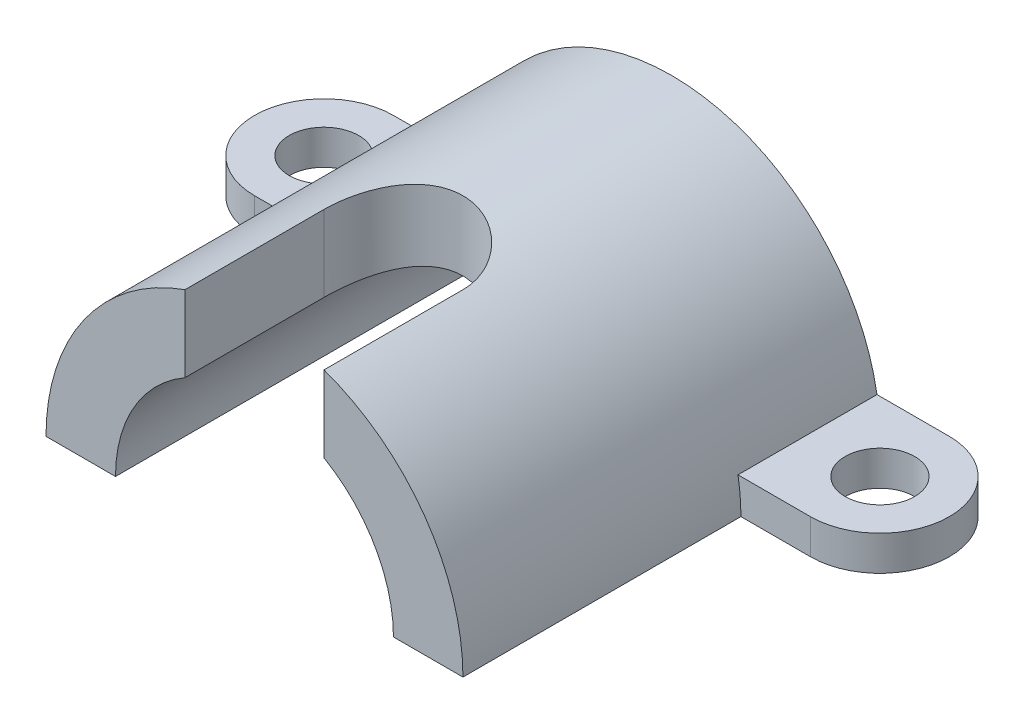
ISO-10303-21;
HEADER;
FILE_DESCRIPTION(('STEP AP214'),'2;1');
FILE_NAME('part.step','',(''),(''),'','','');
FILE_SCHEMA(('AUTOMOTIVE_DESIGN { 1 0 10303 214 1 1 1 1 }'));
ENDSEC;
DATA;
#1=APPLICATION_CONTEXT('core data for automotive mechanical design processes');
#2=APPLICATION_PROTOCOL_DEFINITION('international standard','automotive_design',2000,#1);
#3=PRODUCT_CONTEXT('',#1,'mechanical');
#4=PRODUCT('Part','Part','',(#3));
#5=PRODUCT_RELATED_PRODUCT_CATEGORY('part','',(#4));
#6=PRODUCT_DEFINITION_FORMATION('','',#4);
#7=PRODUCT_DEFINITION_CONTEXT('part definition',#1,'design');
#8=PRODUCT_DEFINITION('design','',#6,#7);
#9=PRODUCT_DEFINITION_SHAPE('','',#8);
#10=(LENGTH_UNIT() NAMED_UNIT(*) SI_UNIT(.MILLI.,.METRE.));
#11=(NAMED_UNIT(*) PLANE_ANGLE_UNIT() SI_UNIT($,.RADIAN.));
#12=(NAMED_UNIT(*) SI_UNIT($,.STERADIAN.) SOLID_ANGLE_UNIT());
#13=UNCERTAINTY_MEASURE_WITH_UNIT(LENGTH_MEASURE(1.E-05),#10,'distance_accuracy_value','');
#14=(GEOMETRIC_REPRESENTATION_CONTEXT(3) GLOBAL_UNCERTAINTY_ASSIGNED_CONTEXT((#13)) GLOBAL_UNIT_ASSIGNED_CONTEXT((#10,
#11,#12)) REPRESENTATION_CONTEXT('',''));
#15=CARTESIAN_POINT('',(0.,0.,0.));
#16=DIRECTION('',(0.,0.,1.));
#17=DIRECTION('',(1.,0.,0.));
#18=AXIS2_PLACEMENT_3D('',#15,#16,#17);
#19=CARTESIAN_POINT('',(0.,0.,40.));
#20=DIRECTION('',(0.,-1.,0.));
#21=DIRECTION('',(0.,0.,-1.));
#22=AXIS2_PLACEMENT_3D('',#19,#20,#21);
#23=CYLINDRICAL_SURFACE('',#22,10.);
#24=CARTESIAN_POINT('',(10.,17.3205080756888,40.));
#25=CARTESIAN_POINT('',(10.0000009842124,17.3205050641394,39.8690518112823));
#26=CARTESIAN_POINT('',(9.99742732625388,17.3219937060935,39.7381220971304));
#27=CARTESIAN_POINT('',(9.98714776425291,17.3279234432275,39.4765381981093));
#28=CARTESIAN_POINT('',(9.9794421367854,17.3323643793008,39.3458839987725));
#29=CARTESIAN_POINT('',(9.94866974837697,17.3500596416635,38.9548912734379));
#30=CARTESIAN_POINT('',(9.91794741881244,17.3676865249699,38.695300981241));
#31=CARTESIAN_POINT('',(9.83673629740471,17.4138095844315,38.1818040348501));
#32=CARTESIAN_POINT('',(9.78636180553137,17.4422428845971,37.9278733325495));
#33=CARTESIAN_POINT('',(9.66646257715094,17.5089748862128,37.4258783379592));
#34=CARTESIAN_POINT('',(9.59693564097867,17.5472747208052,37.1778147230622));
#35=CARTESIAN_POINT('',(9.43968016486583,17.6323679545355,36.6897095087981));
#36=CARTESIAN_POINT('',(9.35199562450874,17.6791407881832,36.4496501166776));
#37=CARTESIAN_POINT('',(9.15913679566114,17.7798210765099,35.9781654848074));
#38=CARTESIAN_POINT('',(9.05395571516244,17.8337313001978,35.7467436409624));
#39=CARTESIAN_POINT('',(8.71317979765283,18.0040295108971,35.0666814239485));
#40=CARTESIAN_POINT('',(8.45244203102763,18.12893414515,34.6325199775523));
#41=CARTESIAN_POINT('',(7.84654710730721,18.3997336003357,33.7767656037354));
#42=CARTESIAN_POINT('',(7.49622958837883,18.5465096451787,33.3591048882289));
#43=CARTESIAN_POINT('',(6.9233891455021,18.7645590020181,32.7791476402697));
#44=CARTESIAN_POINT('',(6.7244100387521,18.8369339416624,32.5934834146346));
#45=CARTESIAN_POINT('',(6.31150716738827,18.9792644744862,32.2386273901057));
#46=CARTESIAN_POINT('',(6.09758884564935,19.0492209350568,32.0694296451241));
#47=CARTESIAN_POINT('',(5.64077173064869,19.1896485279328,31.7376325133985));
#48=CARTESIAN_POINT('',(5.39689141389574,19.2598321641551,31.5762609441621));
#49=CARTESIAN_POINT('',(4.89455061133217,19.3935793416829,31.2747967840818));
#50=CARTESIAN_POINT('',(4.63608928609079,19.4571425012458,31.1347054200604));
#51=CARTESIAN_POINT('',(4.10635677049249,19.5757876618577,30.8772530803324));
#52=CARTESIAN_POINT('',(3.83509177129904,19.6308737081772,30.7598812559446));
#53=CARTESIAN_POINT('',(3.28159507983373,19.7309449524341,30.5491378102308));
#54=CARTESIAN_POINT('',(2.99936455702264,19.7759312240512,30.4557636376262));
#55=CARTESIAN_POINT('',(2.44661833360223,19.8516058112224,30.2999718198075));
#56=CARTESIAN_POINT('',(2.17669780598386,19.8830836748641,30.2358243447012));
#57=CARTESIAN_POINT('',(1.63144213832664,19.9352295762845,30.1300708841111));
#58=CARTESIAN_POINT('',(1.35610723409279,19.9558980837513,30.0884639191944));
#59=CARTESIAN_POINT('',(0.802445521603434,19.9858175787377,30.0283610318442));
#60=CARTESIAN_POINT('',(0.524120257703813,19.995074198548,30.0098537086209));
#61=CARTESIAN_POINT('',(-0.0332395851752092,20.0019136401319,29.9961712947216));
#62=CARTESIAN_POINT('',(-0.312274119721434,19.9994971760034,30.0009947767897));
#63=CARTESIAN_POINT('',(-0.844367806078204,19.9837838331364,30.0324641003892));
#64=CARTESIAN_POINT('',(-1.0975729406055,19.9714527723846,30.0571730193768));
#65=CARTESIAN_POINT('',(-1.60073183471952,19.9374328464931,30.1256841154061));
#66=CARTESIAN_POINT('',(-1.85068582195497,19.9157446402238,30.1694849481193));
#67=CARTESIAN_POINT('',(-2.34565858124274,19.8635300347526,30.2757025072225));
#68=CARTESIAN_POINT('',(-2.59067728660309,19.8330035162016,30.3381194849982));
#69=CARTESIAN_POINT('',(-3.07423528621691,19.7638242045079,30.4809325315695));
#70=CARTESIAN_POINT('',(-3.31277434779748,19.7251711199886,30.561329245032));
#71=CARTESIAN_POINT('',(-3.78518954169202,19.6400282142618,30.7405713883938));
#72=CARTESIAN_POINT('',(-4.01895833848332,19.5934390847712,30.83965255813));
#73=CARTESIAN_POINT('',(-4.47722056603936,19.4938343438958,31.054686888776));
#74=CARTESIAN_POINT('',(-4.70171067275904,19.4408164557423,31.1706460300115));
#75=CARTESIAN_POINT('',(-5.35951315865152,19.2738119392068,31.5425105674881));
#76=CARTESIAN_POINT('',(-5.77743531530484,19.1518223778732,31.8225093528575));
#77=CARTESIAN_POINT('',(-6.6018272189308,18.8844158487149,32.4690181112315));
#78=CARTESIAN_POINT('',(-7.00348722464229,18.7378744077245,32.8412012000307));
#79=CARTESIAN_POINT('',(-7.55652262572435,18.5186003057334,33.4445709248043));
#80=CARTESIAN_POINT('',(-7.73274718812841,18.445540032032,33.653396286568));
#81=CARTESIAN_POINT('',(-8.06789407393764,18.3014290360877,34.0852931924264));
#82=CARTESIAN_POINT('',(-8.22681373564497,18.2303786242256,34.3083669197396));
#83=CARTESIAN_POINT('',(-8.53597765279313,18.0877840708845,34.7825020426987));
#84=CARTESIAN_POINT('',(-8.68500029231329,18.0165039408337,35.0344405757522));
#85=CARTESIAN_POINT('',(-8.96097966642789,17.8808412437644,35.5517721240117));
#86=CARTESIAN_POINT('',(-9.08794650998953,17.816455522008,35.817158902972));
#87=CARTESIAN_POINT('',(-9.31839935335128,17.6970127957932,36.3593871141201));
#88=CARTESIAN_POINT('',(-9.42192743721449,17.6419391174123,36.6362069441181));
#89=CARTESIAN_POINT('',(-9.60448489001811,17.5432230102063,37.1997331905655));
#90=CARTESIAN_POINT('',(-9.68352487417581,17.4995756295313,37.4864352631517));
#91=CARTESIAN_POINT('',(-9.79104748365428,17.439541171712,37.9579580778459));
#92=CARTESIAN_POINT('',(-9.82736239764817,17.4190767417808,38.1405160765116));
#93=CARTESIAN_POINT('',(-9.88980406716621,17.3837011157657,38.5078654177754));
#94=CARTESIAN_POINT('',(-9.91593364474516,17.368788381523,38.692656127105));
#95=CARTESIAN_POINT('',(-9.95786509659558,17.3447842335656,39.0641043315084));
#96=CARTESIAN_POINT('',(-9.973649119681,17.3357028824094,39.2507644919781));
#97=CARTESIAN_POINT('',(-9.99472523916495,17.323553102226,39.6249466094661));
#98=CARTESIAN_POINT('',(-10.0000130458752,17.3204871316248,39.8124688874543));
#99=CARTESIAN_POINT('',(-9.99999999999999,17.3205080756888,40.));
#100=B_SPLINE_CURVE_WITH_KNOTS('',3,(#24,#25,#26,#27,#28,#29,#30,#31,#32,#33,#34,#35,#36,#37,
#38,#39,#40,#41,#42,#43,#44,#45,#46,#47,#48,#49,#50,#51,#52,#53,#54,#55,#56,#57,#58,#59,#60,#61,
#62,#63,#64,#65,#66,#67,#68,#69,#70,#71,#72,#73,#74,#75,#76,#77,#78,#79,#80,#81,#82,#83,#84,#85,
#86,#87,#88,#89,#90,#91,#92,#93,#94,#95,#96,#97,#98,#99),.UNSPECIFIED.,.F.,.F.,(4,2,2,2,2,2,2,2,
2,2,2,2,2,2,2,2,2,2,2,2,2,2,2,2,2,2,2,2,2,2,2,2,2,2,2,2,2,4),(0.,0.392774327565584,
0.785527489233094,1.57037135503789,2.35071691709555,3.13115213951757,3.90971788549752,
4.68858657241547,6.24719698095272,7.93328360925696,8.77737560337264,9.62116165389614,
10.5222327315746,11.4233557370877,12.3240473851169,13.2246432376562,14.0611635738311,
14.8976475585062,15.7337185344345,16.5697383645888,17.3329555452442,18.096118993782,
18.8592927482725,19.6224938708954,20.3960608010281,21.1699024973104,22.7166903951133,
24.4095700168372,25.2573755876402,26.1053113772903,27.007965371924,27.9102045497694,
28.8108106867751,29.7110258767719,30.2724648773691,30.833748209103,31.3959974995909,
31.9584765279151),.UNSPECIFIED.);
#101=CARTESIAN_POINT('',(10.,17.3205080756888,40.));
#102=VERTEX_POINT('',#101);
#103=CARTESIAN_POINT('',(-9.99999999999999,17.3205080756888,40.));
#104=VERTEX_POINT('',#103);
#105=EDGE_CURVE('E147',#102,#104,#100,.T.);
#106=ORIENTED_EDGE('',*,*,#105,.F.);
#107=DIRECTION('',(0.,1.,0.));
#108=VECTOR('',#107,1.);
#109=CARTESIAN_POINT('',(10.,0.,40.));
#110=LINE('',#109,#108);
#111=CARTESIAN_POINT('',(10.,28.2842712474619,40.));
#112=VERTEX_POINT('',#111);
#113=EDGE_CURVE('E179',#112,#102,#110,.F.);
#114=ORIENTED_EDGE('',*,*,#113,.F.);
#115=CARTESIAN_POINT('',(-9.99999999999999,28.2842712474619,40.));
#116=CARTESIAN_POINT('',(-10.0000387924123,28.2842264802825,39.727176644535));
#117=CARTESIAN_POINT('',(-9.98883690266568,28.2882171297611,39.4543701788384));
#118=CARTESIAN_POINT('',(-9.94424041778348,28.3039415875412,38.9108733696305));
#119=CARTESIAN_POINT('',(-9.91085181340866,28.315673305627,38.640182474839));
#120=CARTESIAN_POINT('',(-9.82230119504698,28.3465069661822,38.1036429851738));
#121=CARTESIAN_POINT('',(-9.76720376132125,28.3655870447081,37.8377824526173));
#122=CARTESIAN_POINT('',(-9.63575739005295,28.4105091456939,37.3119496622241));
#123=CARTESIAN_POINT('',(-9.55940768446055,28.4363514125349,37.0519776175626));
#124=CARTESIAN_POINT('',(-9.38619298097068,28.4939938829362,36.5398857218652));
#125=CARTESIAN_POINT('',(-9.28934454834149,28.5257892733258,36.2877597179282));
#126=CARTESIAN_POINT('',(-9.07584153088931,28.5944342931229,35.7926481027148));
#127=CARTESIAN_POINT('',(-8.95917958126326,28.6312858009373,35.5496659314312));
#128=CARTESIAN_POINT('',(-8.70689858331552,28.7090113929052,35.0743177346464));
#129=CARTESIAN_POINT('',(-8.57127278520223,28.7498869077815,34.8419555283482));
#130=CARTESIAN_POINT('',(-8.28201890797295,28.8345429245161,34.3892674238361));
#131=CARTESIAN_POINT('',(-8.12838972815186,28.8783236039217,34.1689422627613));
#132=CARTESIAN_POINT('',(-7.79838011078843,28.9692177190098,33.7340295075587));
#133=CARTESIAN_POINT('',(-7.6213879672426,29.0163942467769,33.5199190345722));
#134=CARTESIAN_POINT('',(-7.25028661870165,29.1113383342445,33.1072243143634));
#135=CARTESIAN_POINT('',(-7.05617709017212,29.1591059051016,32.9086403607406));
#136=CARTESIAN_POINT('',(-6.651990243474,29.2539589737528,32.5281818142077));
#137=CARTESIAN_POINT('',(-6.441909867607,29.3010443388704,32.3463104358));
#138=CARTESIAN_POINT('',(-6.00708660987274,29.3932695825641,32.0004954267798));
#139=CARTESIAN_POINT('',(-5.78234416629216,29.438409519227,31.8365512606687));
#140=CARTESIAN_POINT('',(-5.31343445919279,29.5266965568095,31.5236245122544));
#141=CARTESIAN_POINT('',(-5.06891098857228,29.5697595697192,31.3751512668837));
#142=CARTESIAN_POINT('',(-4.56755046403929,29.651339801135,31.0994782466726));
#143=CARTESIAN_POINT('',(-4.31071832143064,29.6898588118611,30.9722700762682));
#144=CARTESIAN_POINT('',(-3.78642403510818,29.7612663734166,30.7401306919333));
#145=CARTESIAN_POINT('',(-3.51896226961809,29.7941551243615,30.6351986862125));
#146=CARTESIAN_POINT('',(-2.97534494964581,29.8533425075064,30.4485655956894));
#147=CARTESIAN_POINT('',(-2.6991897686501,29.879641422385,30.366863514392));
#148=CARTESIAN_POINT('',(-2.15001476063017,29.9240817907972,30.229906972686));
#149=CARTESIAN_POINT('',(-1.87721995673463,29.9424751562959,30.173831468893));
#150=CARTESIAN_POINT('',(-1.3275127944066,29.97187778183,30.0845959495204));
#151=CARTESIAN_POINT('',(-1.05060052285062,29.9828871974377,30.0514354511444));
#152=CARTESIAN_POINT('',(-0.494831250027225,29.9972065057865,30.0083629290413));
#153=CARTESIAN_POINT('',(-0.215974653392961,30.0005179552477,29.9984462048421));
#154=CARTESIAN_POINT('',(0.341572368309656,29.999350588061,30.0019481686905));
#155=CARTESIAN_POINT('',(0.620262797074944,29.994871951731,30.0153663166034));
#156=CARTESIAN_POINT('',(1.16440565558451,29.9785811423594,30.0644158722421));
#157=CARTESIAN_POINT('',(1.42994803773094,29.967063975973,30.0991539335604));
#158=CARTESIAN_POINT('',(1.95701595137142,29.9372637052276,30.1897204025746));
#159=CARTESIAN_POINT('',(2.21854160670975,29.9189808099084,30.2455481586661));
#160=CARTESIAN_POINT('',(2.73575759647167,29.8761270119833,30.3777927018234));
#161=CARTESIAN_POINT('',(2.99144882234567,29.851557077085,30.4542063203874));
#162=CARTESIAN_POINT('',(3.49546118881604,29.796745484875,30.6270199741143));
#163=CARTESIAN_POINT('',(3.74377949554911,29.766501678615,30.7234275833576));
#164=CARTESIAN_POINT('',(4.23450803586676,29.700690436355,30.9368085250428));
#165=CARTESIAN_POINT('',(4.47680253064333,29.6650600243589,31.054028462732));
#166=CARTESIAN_POINT('',(4.95074987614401,29.5896550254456,31.3073418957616));
#167=CARTESIAN_POINT('',(5.18239876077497,29.5498789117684,31.4434423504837));
#168=CARTESIAN_POINT('',(5.63361763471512,29.4671846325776,31.7335439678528));
#169=CARTESIAN_POINT('',(5.85318718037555,29.4242663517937,31.8875457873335));
#170=CARTESIAN_POINT('',(6.27900118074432,29.3363497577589,32.2124540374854));
#171=CARTESIAN_POINT('',(6.48524515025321,29.291351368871,32.3833610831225));
#172=CARTESIAN_POINT('',(6.89266306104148,29.1982345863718,32.7495029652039));
#173=CARTESIAN_POINT('',(7.09313668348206,29.1500692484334,32.9455058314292));
#174=CARTESIAN_POINT('',(7.47687411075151,29.0540095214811,33.3535896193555));
#175=CARTESIAN_POINT('',(7.66014503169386,29.0061150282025,33.5656638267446));
#176=CARTESIAN_POINT('',(8.00852948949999,28.9118669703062,34.0048293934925));
#177=CARTESIAN_POINT('',(8.17362931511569,28.8655145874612,34.2319318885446));
#178=CARTESIAN_POINT('',(8.48432319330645,28.7757260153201,34.6995262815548));
#179=CARTESIAN_POINT('',(8.62992497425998,28.7322886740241,34.9400128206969));
#180=CARTESIAN_POINT('',(8.90269365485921,28.6489564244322,35.436718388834));
#181=CARTESIAN_POINT('',(9.02954551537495,28.6091256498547,35.6931214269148));
#182=CARTESIAN_POINT('',(9.2610158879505,28.5350373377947,36.2164296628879));
#183=CARTESIAN_POINT('',(9.36564366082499,28.5007774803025,36.4833304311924));
#184=CARTESIAN_POINT('',(9.55168206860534,28.4389695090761,37.0255381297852));
#185=CARTESIAN_POINT('',(9.63311795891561,28.4114140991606,37.3008355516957));
#186=CARTESIAN_POINT('',(9.772097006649,28.363911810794,37.8579216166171));
#187=CARTESIAN_POINT('',(9.82965107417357,28.3439614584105,38.1397072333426));
#188=CARTESIAN_POINT('',(9.91654882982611,28.3136733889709,38.6841058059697));
#189=CARTESIAN_POINT('',(9.94783425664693,28.3026763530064,38.9463736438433));
#190=CARTESIAN_POINT('',(9.98956249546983,28.2879607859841,39.4724209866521));
#191=CARTESIAN_POINT('',(10.0000322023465,28.2842328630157,39.7361980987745));
#192=CARTESIAN_POINT('',(10.,28.2842712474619,40.));
#193=B_SPLINE_CURVE_WITH_KNOTS('',3,(#115,#116,#117,#118,#119,#120,#121,#122,#123,#124,#125,
#126,#127,#128,#129,#130,#131,#132,#133,#134,#135,#136,#137,#138,#139,#140,#141,#142,#143,#144,
#145,#146,#147,#148,#149,#150,#151,#152,#153,#154,#155,#156,#157,#158,#159,#160,#161,#162,#163,
#164,#165,#166,#167,#168,#169,#170,#171,#172,#173,#174,#175,#176,#177,#178,#179,#180,#181,#182,
#183,#184,#185,#186,#187,#188,#189,#190,#191,#192),.UNSPECIFIED.,.F.,.F.,(4,2,2,2,2,2,2,2,2,2,2,
2,2,2,2,2,2,2,2,2,2,2,2,2,2,2,2,2,2,2,2,2,2,2,2,2,2,2,4),(0.,0.818184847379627,1.63614886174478,
2.45169771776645,3.26727605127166,4.08219780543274,4.89742313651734,5.7129393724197,
6.52850549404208,7.37286263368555,8.21723573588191,9.06177090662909,9.90628084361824,
10.7730890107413,11.6395541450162,12.5059884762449,13.3723856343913,14.2086484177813,
15.0448935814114,15.8809696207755,16.7170263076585,17.5202388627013,18.3234266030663,
19.1264907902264,19.9298597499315,20.7434745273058,21.5573900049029,22.3713353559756,
23.1853103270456,24.0377558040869,24.8898470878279,25.7425769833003,26.5949678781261,
27.46035943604,28.3253896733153,29.1894742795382,30.0531637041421,30.8453164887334,
31.6364451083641),.UNSPECIFIED.);
#194=CARTESIAN_POINT('',(-9.99999999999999,28.2842712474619,40.));
#195=VERTEX_POINT('',#194);
#196=EDGE_CURVE('E39',#112,#195,#193,.F.);
#197=ORIENTED_EDGE('',*,*,#196,.T.);
#198=DIRECTION('',(0.,1.,0.));
#199=VECTOR('',#198,1.);
#200=CARTESIAN_POINT('',(-9.99999999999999,0.,40.));
#201=LINE('',#200,#199);
#202=EDGE_CURVE('E177',#104,#195,#201,.T.);
#203=ORIENTED_EDGE('',*,*,#202,.F.);
#204=EDGE_LOOP('',(#106,#114,#197,#203));
#205=FACE_BOUND('',#204,.T.);
#206=ADVANCED_FACE('F31',(#205),#23,.F.);
#207=CARTESIAN_POINT('',(-30.,0.,60.));
#208=DIRECTION('',(0.,1.,0.));
#209=DIRECTION('',(0.,0.,1.));
#210=AXIS2_PLACEMENT_3D('',#207,#208,#209);
#211=PLANE('',#210);
#212=CARTESIAN_POINT('',(40.,0.,9.99999999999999));
#213=DIRECTION('',(0.,1.,0.));
#214=DIRECTION('',(0.,0.,1.));
#215=AXIS2_PLACEMENT_3D('',#212,#213,#214);
#216=CIRCLE('',#215,5.);
#217=CARTESIAN_POINT('',(40.,0.,15.));
#218=VERTEX_POINT('',#217);
#219=EDGE_CURVE('E252',#218,#218,#216,.T.);
#220=ORIENTED_EDGE('',*,*,#219,.T.);
#221=EDGE_LOOP('',(#220));
#222=FACE_BOUND('',#221,.T.);
#223=DIRECTION('',(0.,0.,-1.));
#224=VECTOR('',#223,1.);
#225=CARTESIAN_POINT('',(20.,0.,60.));
#226=LINE('',#225,#224);
#227=CARTESIAN_POINT('',(20.,0.,0.));
#228=VERTEX_POINT('',#227);
#229=CARTESIAN_POINT('',(20.,0.,60.));
#230=VERTEX_POINT('',#229);
#231=EDGE_CURVE('E130',#228,#230,#226,.F.);
#232=ORIENTED_EDGE('',*,*,#231,.F.);
#233=DIRECTION('',(1.,0.,0.));
#234=VECTOR('',#233,1.);
#235=CARTESIAN_POINT('',(-30.,0.,0.));
#236=LINE('',#235,#234);
#237=CARTESIAN_POINT('',(40.,0.,0.));
#238=VERTEX_POINT('',#237);
#239=EDGE_CURVE('E165',#228,#238,#236,.T.);
#240=ORIENTED_EDGE('',*,*,#239,.T.);
#241=CARTESIAN_POINT('',(40.,0.,9.99999999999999));
#242=DIRECTION('',(0.,-1.,0.));
#243=DIRECTION('',(0.,0.,-1.));
#244=AXIS2_PLACEMENT_3D('',#241,#242,#243);
#245=CIRCLE('',#244,10.);
#246=CARTESIAN_POINT('',(40.,0.,20.));
#247=VERTEX_POINT('',#246);
#248=EDGE_CURVE('E282',#238,#247,#245,.T.);
#249=ORIENTED_EDGE('',*,*,#248,.T.);
#250=DIRECTION('',(-1.,0.,0.));
#251=VECTOR('',#250,1.);
#252=CARTESIAN_POINT('',(-40.,0.,20.));
#253=LINE('',#252,#251);
#254=CARTESIAN_POINT('',(30.,0.,20.));
#255=VERTEX_POINT('',#254);
#256=EDGE_CURVE('E268',#247,#255,#253,.T.);
#257=ORIENTED_EDGE('',*,*,#256,.T.);
#258=DIRECTION('',(0.,0.,-1.));
#259=VECTOR('',#258,1.);
#260=CARTESIAN_POINT('',(30.,0.,60.));
#261=LINE('',#260,#259);
#262=CARTESIAN_POINT('',(30.,0.,60.));
#263=VERTEX_POINT('',#262);
#264=EDGE_CURVE('E152',#263,#255,#261,.T.);
#265=ORIENTED_EDGE('',*,*,#264,.F.);
#266=DIRECTION('',(1.,0.,0.));
#267=VECTOR('',#266,1.);
#268=CARTESIAN_POINT('',(-30.,0.,60.));
#269=LINE('',#268,#267);
#270=EDGE_CURVE('E144',#230,#263,#269,.T.);
#271=ORIENTED_EDGE('',*,*,#270,.F.);
#272=EDGE_LOOP('',(#232,#240,#249,#257,#265,#271));
#273=FACE_BOUND('',#272,.T.);
#274=ADVANCED_FACE('F150',(#222,#273),#211,.F.);
#275=CARTESIAN_POINT('',(-40.,0.,10.));
#276=DIRECTION('',(0.,1.,0.));
#277=DIRECTION('',(0.,0.,1.));
#278=AXIS2_PLACEMENT_3D('',#275,#276,#277);
#279=CIRCLE('',#278,5.);
#280=CARTESIAN_POINT('',(-40.,0.,15.));
#281=VERTEX_POINT('',#280);
#282=EDGE_CURVE('E258',#281,#281,#279,.T.);
#283=ORIENTED_EDGE('',*,*,#282,.T.);
#284=EDGE_LOOP('',(#283));
#285=FACE_BOUND('',#284,.T.);
#286=DIRECTION('',(0.,0.,-1.));
#287=VECTOR('',#286,1.);
#288=CARTESIAN_POINT('',(-20.,0.,60.));
#289=LINE('',#288,#287);
#290=CARTESIAN_POINT('',(-20.,0.,60.));
#291=VERTEX_POINT('',#290);
#292=CARTESIAN_POINT('',(-20.,0.,0.));
#293=VERTEX_POINT('',#292);
#294=EDGE_CURVE('E138',#291,#293,#289,.T.);
#295=ORIENTED_EDGE('',*,*,#294,.F.);
#296=CARTESIAN_POINT('',(-30.,0.,60.));
#297=VERTEX_POINT('',#296);
#298=EDGE_CURVE('E154',#297,#291,#269,.T.);
#299=ORIENTED_EDGE('',*,*,#298,.F.);
#300=DIRECTION('',(0.,0.,-1.));
#301=VECTOR('',#300,1.);
#302=CARTESIAN_POINT('',(-30.,0.,60.));
#303=LINE('',#302,#301);
#304=CARTESIAN_POINT('',(-30.,0.,20.));
#305=VERTEX_POINT('',#304);
#306=EDGE_CURVE('E171',#297,#305,#303,.T.);
#307=ORIENTED_EDGE('',*,*,#306,.T.);
#308=CARTESIAN_POINT('',(-40.,0.,20.));
#309=VERTEX_POINT('',#308);
#310=EDGE_CURVE('E285',#305,#309,#253,.T.);
#311=ORIENTED_EDGE('',*,*,#310,.T.);
#312=CARTESIAN_POINT('',(-40.,0.,10.));
#313=DIRECTION('',(0.,-1.,0.));
#314=DIRECTION('',(0.,0.,-1.));
#315=AXIS2_PLACEMENT_3D('',#312,#313,#314);
#316=CIRCLE('',#315,10.);
#317=CARTESIAN_POINT('',(-40.,0.,0.));
#318=VERTEX_POINT('',#317);
#319=EDGE_CURVE('E261',#309,#318,#316,.T.);
#320=ORIENTED_EDGE('',*,*,#319,.T.);
#321=EDGE_CURVE('E167',#318,#293,#236,.T.);
#322=ORIENTED_EDGE('',*,*,#321,.T.);
#323=EDGE_LOOP('',(#295,#299,#307,#311,#320,#322));
#324=FACE_BOUND('',#323,.T.);
#325=ADVANCED_FACE('F192',(#285,#324),#211,.F.);
#326=CARTESIAN_POINT('',(0.,0.,60.));
#327=DIRECTION('',(0.,0.,1.));
#328=DIRECTION('',(1.,0.,0.));
#329=AXIS2_PLACEMENT_3D('',#326,#327,#328);
#330=PLANE('',#329);
#331=ORIENTED_EDGE('',*,*,#298,.T.);
#332=CARTESIAN_POINT('',(0.,0.,60.));
#333=DIRECTION('',(0.,0.,1.));
#334=DIRECTION('',(1.,0.,0.));
#335=AXIS2_PLACEMENT_3D('',#332,#333,#334);
#336=CIRCLE('',#335,20.);
#337=CARTESIAN_POINT('',(-9.99999999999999,17.3205080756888,60.));
#338=VERTEX_POINT('',#337);
#339=EDGE_CURVE('E148',#338,#291,#336,.T.);
#340=ORIENTED_EDGE('',*,*,#339,.F.);
#341=DIRECTION('',(0.,1.,0.));
#342=VECTOR('',#341,1.);
#343=CARTESIAN_POINT('',(-9.99999999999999,0.,60.));
#344=LINE('',#343,#342);
#345=CARTESIAN_POINT('',(-9.99999999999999,28.2842712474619,60.));
#346=VERTEX_POINT('',#345);
#347=EDGE_CURVE('E175',#338,#346,#344,.T.);
#348=ORIENTED_EDGE('',*,*,#347,.T.);
#349=CARTESIAN_POINT('',(0.,0.,60.));
#350=DIRECTION('',(0.,0.,1.));
#351=DIRECTION('',(1.,0.,0.));
#352=AXIS2_PLACEMENT_3D('',#349,#350,#351);
#353=CIRCLE('',#352,30.);
#354=EDGE_CURVE('E158',#346,#297,#353,.T.);
#355=ORIENTED_EDGE('',*,*,#354,.T.);
#356=EDGE_LOOP('',(#331,#340,#348,#355));
#357=FACE_BOUND('',#356,.T.);
#358=ADVANCED_FACE('F199',(#357),#330,.T.);
#359=DIRECTION('',(0.,-1.,0.));
#360=VECTOR('',#359,1.);
#361=CARTESIAN_POINT('',(10.,0.,60.));
#362=LINE('',#361,#360);
#363=CARTESIAN_POINT('',(10.,28.2842712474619,60.));
#364=VERTEX_POINT('',#363);
#365=CARTESIAN_POINT('',(10.,17.3205080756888,60.));
#366=VERTEX_POINT('',#365);
#367=EDGE_CURVE('E146',#364,#366,#362,.T.);
#368=ORIENTED_EDGE('',*,*,#367,.T.);
#369=EDGE_CURVE('E46',#230,#366,#336,.T.);
#370=ORIENTED_EDGE('',*,*,#369,.F.);
#371=ORIENTED_EDGE('',*,*,#270,.T.);
#372=EDGE_CURVE('E155',#263,#364,#353,.T.);
#373=ORIENTED_EDGE('',*,*,#372,.T.);
#374=EDGE_LOOP('',(#368,#370,#371,#373));
#375=FACE_BOUND('',#374,.T.);
#376=ADVANCED_FACE('F142',(#375),#330,.T.);
#377=CARTESIAN_POINT('',(0.,0.,0.));
#378=DIRECTION('',(0.,0.,1.));
#379=DIRECTION('',(1.,0.,0.));
#380=AXIS2_PLACEMENT_3D('',#377,#378,#379);
#381=PLANE('',#380);
#382=CARTESIAN_POINT('',(0.,0.,0.));
#383=DIRECTION('',(0.,0.,1.));
#384=DIRECTION('',(1.,0.,0.));
#385=AXIS2_PLACEMENT_3D('',#382,#383,#384);
#386=CIRCLE('',#385,20.);
#387=EDGE_CURVE('E133',#228,#293,#386,.T.);
#388=ORIENTED_EDGE('',*,*,#387,.T.);
#389=ORIENTED_EDGE('',*,*,#321,.F.);
#390=DIRECTION('',(0.,-1.,0.));
#391=VECTOR('',#390,1.);
#392=CARTESIAN_POINT('',(-40.,5.,0.));
#393=LINE('',#392,#391);
#394=CARTESIAN_POINT('',(-40.,5.,0.));
#395=VERTEX_POINT('',#394);
#396=EDGE_CURVE('E279',#395,#318,#393,.T.);
#397=ORIENTED_EDGE('',*,*,#396,.F.);
#398=DIRECTION('',(1.,0.,0.));
#399=VECTOR('',#398,1.);
#400=CARTESIAN_POINT('',(-40.,5.,0.));
#401=LINE('',#400,#399);
#402=CARTESIAN_POINT('',(-29.5803989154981,5.,0.));
#403=VERTEX_POINT('',#402);
#404=EDGE_CURVE('E269',#395,#403,#401,.T.);
#405=ORIENTED_EDGE('',*,*,#404,.T.);
#406=CARTESIAN_POINT('',(0.,0.,0.));
#407=DIRECTION('',(0.,0.,1.));
#408=DIRECTION('',(1.,0.,0.));
#409=AXIS2_PLACEMENT_3D('',#406,#407,#408);
#410=CIRCLE('',#409,30.);
#411=CARTESIAN_POINT('',(29.5803989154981,5.,0.));
#412=VERTEX_POINT('',#411);
#413=EDGE_CURVE('E162',#412,#403,#410,.T.);
#414=ORIENTED_EDGE('',*,*,#413,.F.);
#415=CARTESIAN_POINT('',(40.,5.,0.));
#416=VERTEX_POINT('',#415);
#417=EDGE_CURVE('E267',#412,#416,#401,.T.);
#418=ORIENTED_EDGE('',*,*,#417,.T.);
#419=DIRECTION('',(0.,-1.,0.));
#420=VECTOR('',#419,1.);
#421=CARTESIAN_POINT('',(40.,5.,0.));
#422=LINE('',#421,#420);
#423=EDGE_CURVE('E293',#416,#238,#422,.T.);
#424=ORIENTED_EDGE('',*,*,#423,.T.);
#425=ORIENTED_EDGE('',*,*,#239,.F.);
#426=EDGE_LOOP('',(#388,#389,#397,#405,#414,#418,#424,#425));
#427=FACE_BOUND('',#426,.T.);
#428=ADVANCED_FACE('F194',(#427),#381,.F.);
#429=CARTESIAN_POINT('',(-10.,30.,30.));
#430=DIRECTION('',(1.,0.,0.));
#431=DIRECTION('',(0.,0.,-1.));
#432=AXIS2_PLACEMENT_3D('',#429,#430,#431);
#433=PLANE('',#432);
#434=ORIENTED_EDGE('',*,*,#347,.F.);
#435=DIRECTION('',(0.,0.,-1.));
#436=VECTOR('',#435,1.);
#437=CARTESIAN_POINT('',(-9.99999999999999,17.3205080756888,60.));
#438=LINE('',#437,#436);
#439=EDGE_CURVE('E242',#338,#104,#438,.T.);
#440=ORIENTED_EDGE('',*,*,#439,.T.);
#441=ORIENTED_EDGE('',*,*,#202,.T.);
#442=DIRECTION('',(0.,0.,-1.));
#443=VECTOR('',#442,1.);
#444=CARTESIAN_POINT('',(-9.99999999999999,28.2842712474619,60.));
#445=LINE('',#444,#443);
#446=EDGE_CURVE('E248',#195,#346,#445,.F.);
#447=ORIENTED_EDGE('',*,*,#446,.T.);
#448=EDGE_LOOP('',(#434,#440,#441,#447));
#449=FACE_BOUND('',#448,.T.);
#450=ADVANCED_FACE('F197',(#449),#433,.T.);
#451=CARTESIAN_POINT('',(10.,30.,30.));
#452=DIRECTION('',(-1.,0.,0.));
#453=DIRECTION('',(0.,0.,1.));
#454=AXIS2_PLACEMENT_3D('',#451,#452,#453);
#455=PLANE('',#454);
#456=ORIENTED_EDGE('',*,*,#113,.T.);
#457=DIRECTION('',(0.,0.,-1.));
#458=VECTOR('',#457,1.);
#459=CARTESIAN_POINT('',(10.,17.3205080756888,60.));
#460=LINE('',#459,#458);
#461=EDGE_CURVE('E11',#102,#366,#460,.F.);
#462=ORIENTED_EDGE('',*,*,#461,.T.);
#463=ORIENTED_EDGE('',*,*,#367,.F.);
#464=DIRECTION('',(0.,0.,-1.));
#465=VECTOR('',#464,1.);
#466=CARTESIAN_POINT('',(10.,28.2842712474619,60.));
#467=LINE('',#466,#465);
#468=EDGE_CURVE('E137',#364,#112,#467,.T.);
#469=ORIENTED_EDGE('',*,*,#468,.T.);
#470=EDGE_LOOP('',(#456,#462,#463,#469));
#471=FACE_BOUND('',#470,.T.);
#472=ADVANCED_FACE('F189',(#471),#455,.T.);
#473=CARTESIAN_POINT('',(0.,0.,60.));
#474=DIRECTION('',(0.,0.,-1.));
#475=DIRECTION('',(-1.,0.,0.));
#476=AXIS2_PLACEMENT_3D('',#473,#474,#475);
#477=CYLINDRICAL_SURFACE('',#476,30.);
#478=ORIENTED_EDGE('',*,*,#468,.F.);
#479=ORIENTED_EDGE('',*,*,#372,.F.);
#480=ORIENTED_EDGE('',*,*,#264,.T.);
#481=CARTESIAN_POINT('',(0.,0.,20.));
#482=DIRECTION('',(0.,0.,1.));
#483=DIRECTION('',(1.,0.,0.));
#484=AXIS2_PLACEMENT_3D('',#481,#482,#483);
#485=CIRCLE('',#484,30.);
#486=CARTESIAN_POINT('',(29.5803989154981,5.,20.));
#487=VERTEX_POINT('',#486);
#488=EDGE_CURVE('E166',#255,#487,#485,.T.);
#489=ORIENTED_EDGE('',*,*,#488,.T.);
#490=DIRECTION('',(0.,0.,-1.));
#491=VECTOR('',#490,1.);
#492=CARTESIAN_POINT('',(29.5803989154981,5.,60.));
#493=LINE('',#492,#491);
#494=EDGE_CURVE('E290',#412,#487,#493,.F.);
#495=ORIENTED_EDGE('',*,*,#494,.F.);
#496=ORIENTED_EDGE('',*,*,#413,.T.);
#497=DIRECTION('',(0.,0.,-1.));
#498=VECTOR('',#497,1.);
#499=CARTESIAN_POINT('',(-29.5803989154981,5.,60.));
#500=LINE('',#499,#498);
#501=CARTESIAN_POINT('',(-29.5803989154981,5.,20.));
#502=VERTEX_POINT('',#501);
#503=EDGE_CURVE('E300',#502,#403,#500,.T.);
#504=ORIENTED_EDGE('',*,*,#503,.F.);
#505=EDGE_CURVE('E301',#502,#305,#485,.T.);
#506=ORIENTED_EDGE('',*,*,#505,.T.);
#507=ORIENTED_EDGE('',*,*,#306,.F.);
#508=ORIENTED_EDGE('',*,*,#354,.F.);
#509=ORIENTED_EDGE('',*,*,#446,.F.);
#510=ORIENTED_EDGE('',*,*,#196,.F.);
#511=EDGE_LOOP('',(#478,#479,#480,#489,#495,#496,#504,#506,#507,#508,#509,#510));
#512=FACE_BOUND('',#511,.T.);
#513=ADVANCED_FACE('F184',(#512),#477,.T.);
#514=CARTESIAN_POINT('',(40.,5.,9.99999999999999));
#515=DIRECTION('',(0.,-1.,0.));
#516=DIRECTION('',(0.,0.,-1.));
#517=AXIS2_PLACEMENT_3D('',#514,#515,#516);
#518=CYLINDRICAL_SURFACE('',#517,10.);
#519=ORIENTED_EDGE('',*,*,#248,.F.);
#520=ORIENTED_EDGE('',*,*,#423,.F.);
#521=CARTESIAN_POINT('',(40.,5.,9.99999999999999));
#522=DIRECTION('',(0.,-1.,0.));
#523=DIRECTION('',(0.,0.,-1.));
#524=AXIS2_PLACEMENT_3D('',#521,#522,#523);
#525=CIRCLE('',#524,10.);
#526=CARTESIAN_POINT('',(40.,5.,20.));
#527=VERTEX_POINT('',#526);
#528=EDGE_CURVE('E272',#416,#527,#525,.T.);
#529=ORIENTED_EDGE('',*,*,#528,.T.);
#530=DIRECTION('',(0.,-1.,0.));
#531=VECTOR('',#530,1.);
#532=CARTESIAN_POINT('',(40.,5.,20.));
#533=LINE('',#532,#531);
#534=EDGE_CURVE('E291',#527,#247,#533,.T.);
#535=ORIENTED_EDGE('',*,*,#534,.T.);
#536=EDGE_LOOP('',(#519,#520,#529,#535));
#537=FACE_BOUND('',#536,.T.);
#538=ADVANCED_FACE('F188',(#537),#518,.T.);
#539=CARTESIAN_POINT('',(-40.,5.,10.));
#540=DIRECTION('',(0.,-1.,0.));
#541=DIRECTION('',(0.,0.,-1.));
#542=AXIS2_PLACEMENT_3D('',#539,#540,#541);
#543=PLANE('',#542);
#544=CARTESIAN_POINT('',(40.,5.,9.99999999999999));
#545=DIRECTION('',(0.,1.,0.));
#546=DIRECTION('',(0.,0.,1.));
#547=AXIS2_PLACEMENT_3D('',#544,#545,#546);
#548=CIRCLE('',#547,5.);
#549=CARTESIAN_POINT('',(40.,5.,15.));
#550=VERTEX_POINT('',#549);
#551=EDGE_CURVE('E251',#550,#550,#548,.T.);
#552=ORIENTED_EDGE('',*,*,#551,.F.);
#553=EDGE_LOOP('',(#552));
#554=FACE_BOUND('',#553,.T.);
#555=ORIENTED_EDGE('',*,*,#417,.F.);
#556=ORIENTED_EDGE('',*,*,#494,.T.);
#557=DIRECTION('',(-1.,0.,0.));
#558=VECTOR('',#557,1.);
#559=CARTESIAN_POINT('',(-40.,5.,20.));
#560=LINE('',#559,#558);
#561=EDGE_CURVE('E276',#527,#487,#560,.T.);
#562=ORIENTED_EDGE('',*,*,#561,.F.);
#563=ORIENTED_EDGE('',*,*,#528,.F.);
#564=EDGE_LOOP('',(#555,#556,#562,#563));
#565=FACE_BOUND('',#564,.T.);
#566=ADVANCED_FACE('F211',(#554,#565),#543,.F.);
#567=CARTESIAN_POINT('',(-40.,5.,20.));
#568=DIRECTION('',(0.,0.,1.));
#569=DIRECTION('',(1.,0.,0.));
#570=AXIS2_PLACEMENT_3D('',#567,#568,#569);
#571=PLANE('',#570);
#572=ORIENTED_EDGE('',*,*,#488,.F.);
#573=ORIENTED_EDGE('',*,*,#256,.F.);
#574=ORIENTED_EDGE('',*,*,#534,.F.);
#575=ORIENTED_EDGE('',*,*,#561,.T.);
#576=EDGE_LOOP('',(#572,#573,#574,#575));
#577=FACE_BOUND('',#576,.T.);
#578=ADVANCED_FACE('F213',(#577),#571,.T.);
#579=ORIENTED_EDGE('',*,*,#505,.F.);
#580=CARTESIAN_POINT('',(-40.,5.,20.));
#581=VERTEX_POINT('',#580);
#582=EDGE_CURVE('E275',#502,#581,#560,.T.);
#583=ORIENTED_EDGE('',*,*,#582,.T.);
#584=DIRECTION('',(0.,-1.,0.));
#585=VECTOR('',#584,1.);
#586=CARTESIAN_POINT('',(-40.,5.,20.));
#587=LINE('',#586,#585);
#588=EDGE_CURVE('E287',#581,#309,#587,.T.);
#589=ORIENTED_EDGE('',*,*,#588,.T.);
#590=ORIENTED_EDGE('',*,*,#310,.F.);
#591=EDGE_LOOP('',(#579,#583,#589,#590));
#592=FACE_BOUND('',#591,.T.);
#593=ADVANCED_FACE('F216',(#592),#571,.T.);
#594=CARTESIAN_POINT('',(-40.,5.,10.));
#595=DIRECTION('',(0.,1.,0.));
#596=DIRECTION('',(0.,0.,1.));
#597=AXIS2_PLACEMENT_3D('',#594,#595,#596);
#598=CIRCLE('',#597,5.);
#599=CARTESIAN_POINT('',(-40.,5.,15.));
#600=VERTEX_POINT('',#599);
#601=EDGE_CURVE('E255',#600,#600,#598,.T.);
#602=ORIENTED_EDGE('',*,*,#601,.F.);
#603=EDGE_LOOP('',(#602));
#604=FACE_BOUND('',#603,.T.);
#605=ORIENTED_EDGE('',*,*,#582,.F.);
#606=ORIENTED_EDGE('',*,*,#503,.T.);
#607=ORIENTED_EDGE('',*,*,#404,.F.);
#608=CARTESIAN_POINT('',(-40.,5.,10.));
#609=DIRECTION('',(0.,-1.,0.));
#610=DIRECTION('',(0.,0.,-1.));
#611=AXIS2_PLACEMENT_3D('',#608,#609,#610);
#612=CIRCLE('',#611,10.);
#613=EDGE_CURVE('E264',#581,#395,#612,.T.);
#614=ORIENTED_EDGE('',*,*,#613,.F.);
#615=EDGE_LOOP('',(#605,#606,#607,#614));
#616=FACE_BOUND('',#615,.T.);
#617=ADVANCED_FACE('F207',(#604,#616),#543,.F.);
#618=CARTESIAN_POINT('',(-40.,5.,10.));
#619=DIRECTION('',(0.,-1.,0.));
#620=DIRECTION('',(0.,0.,-1.));
#621=AXIS2_PLACEMENT_3D('',#618,#619,#620);
#622=CYLINDRICAL_SURFACE('',#621,10.);
#623=ORIENTED_EDGE('',*,*,#319,.F.);
#624=ORIENTED_EDGE('',*,*,#588,.F.);
#625=ORIENTED_EDGE('',*,*,#613,.T.);
#626=ORIENTED_EDGE('',*,*,#396,.T.);
#627=EDGE_LOOP('',(#623,#624,#625,#626));
#628=FACE_BOUND('',#627,.T.);
#629=ADVANCED_FACE('F203',(#628),#622,.T.);
#630=CARTESIAN_POINT('',(-40.,0.,10.));
#631=DIRECTION('',(0.,1.,0.));
#632=DIRECTION('',(0.,0.,1.));
#633=AXIS2_PLACEMENT_3D('',#630,#631,#632);
#634=CYLINDRICAL_SURFACE('',#633,5.);
#635=ORIENTED_EDGE('',*,*,#282,.F.);
#636=EDGE_LOOP('',(#635));
#637=FACE_BOUND('',#636,.T.);
#638=ORIENTED_EDGE('',*,*,#601,.T.);
#639=EDGE_LOOP('',(#638));
#640=FACE_BOUND('',#639,.T.);
#641=ADVANCED_FACE('F206',(#637,#640),#634,.F.);
#642=CARTESIAN_POINT('',(40.,0.,9.99999999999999));
#643=DIRECTION('',(0.,1.,0.));
#644=DIRECTION('',(0.,0.,1.));
#645=AXIS2_PLACEMENT_3D('',#642,#643,#644);
#646=CYLINDRICAL_SURFACE('',#645,5.);
#647=ORIENTED_EDGE('',*,*,#219,.F.);
#648=EDGE_LOOP('',(#647));
#649=FACE_BOUND('',#648,.T.);
#650=ORIENTED_EDGE('',*,*,#551,.T.);
#651=EDGE_LOOP('',(#650));
#652=FACE_BOUND('',#651,.T.);
#653=ADVANCED_FACE('F223',(#649,#652),#646,.F.);
#654=CARTESIAN_POINT('',(0.,0.,60.));
#655=DIRECTION('',(0.,0.,-1.));
#656=DIRECTION('',(-1.,0.,0.));
#657=AXIS2_PLACEMENT_3D('',#654,#655,#656);
#658=CYLINDRICAL_SURFACE('',#657,20.);
#659=ORIENTED_EDGE('',*,*,#231,.T.);
#660=ORIENTED_EDGE('',*,*,#369,.T.);
#661=ORIENTED_EDGE('',*,*,#461,.F.);
#662=ORIENTED_EDGE('',*,*,#105,.T.);
#663=ORIENTED_EDGE('',*,*,#439,.F.);
#664=ORIENTED_EDGE('',*,*,#339,.T.);
#665=ORIENTED_EDGE('',*,*,#294,.T.);
#666=ORIENTED_EDGE('',*,*,#387,.F.);
#667=EDGE_LOOP('',(#659,#660,#661,#662,#663,#664,#665,#666));
#668=FACE_BOUND('',#667,.T.);
#669=ADVANCED_FACE('F131',(#668),#658,.F.);
#670=CLOSED_SHELL('',(#206,#274,#325,#358,#376,#428,#450,#472,#513,#538,#566,#578,#593,#617,
#629,#641,#653,#669));
#671=MANIFOLD_SOLID_BREP('B2',#670);
#672=ADVANCED_BREP_SHAPE_REPRESENTATION('',(#18,#671),#14);
#673=SHAPE_DEFINITION_REPRESENTATION(#9,#672);
ENDSEC;
END-ISO-10303-21;
